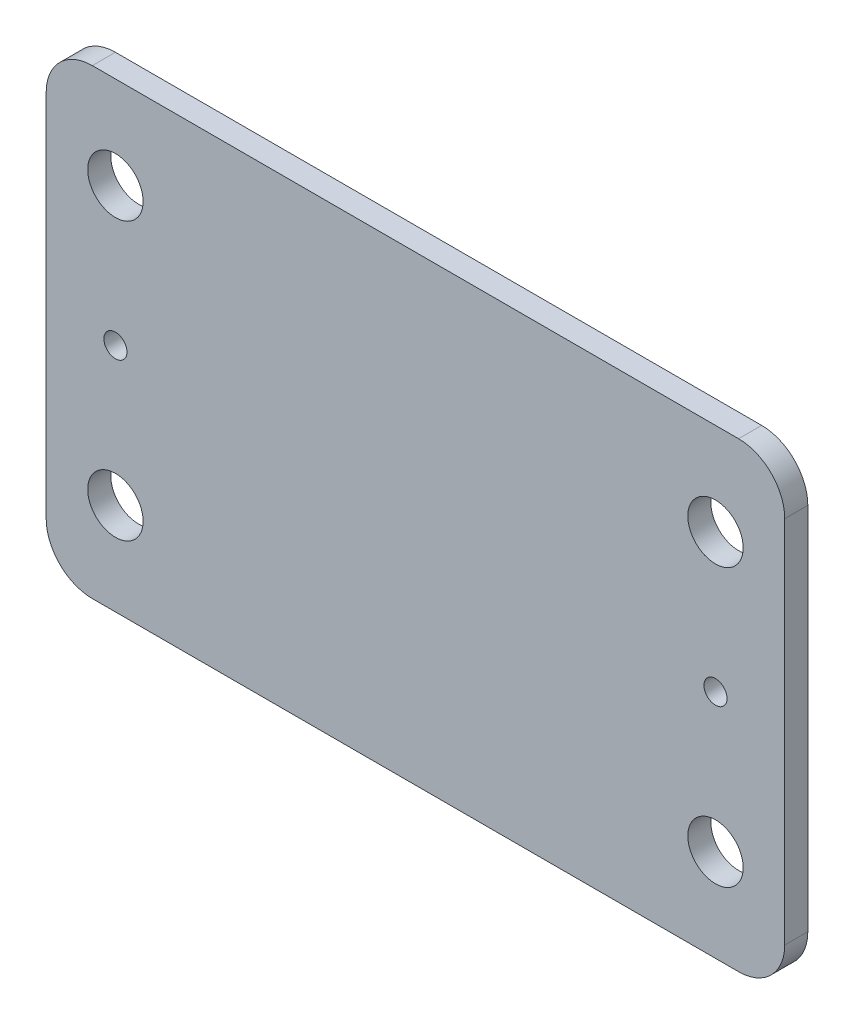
from build123d import *

# Parameters (mm, degrees)
ESQUISSE1_W             = 160
ESQUISSE1_H             = 100
BOSS_EXTRU_1_DEPTH      = 5
ESQUISSE2_R             = 6
ENL_V_MAT_EXTRU_1_DEPTH = 189.745860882
CONG_1_R                = 10
ESQUISSE3_R             = 2.5
ENL_V_MAT_EXTRU_2_DEPTH = 189.745860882


with BuildPart() as part:
    # Esquisse1 → Boss.-Extru.1 (new body)
    with BuildSketch(Plane.XY):
        with Locations((80, 50)):
            Rectangle(ESQUISSE1_W, ESQUISSE1_H)
    extrude(amount=BOSS_EXTRU_1_DEPTH)

    # Esquisse2 → Enl_v. mat.-Extru.1 (cut, through all)
    with BuildSketch(Plane.XY.offset(5)):
        with Locations((15, 80)):
            Circle(ESQUISSE2_R)
        with Locations((145, 80)):
            Circle(ESQUISSE2_R)
        with Locations((15, 20)):
            Circle(ESQUISSE2_R)
        with Locations((145, 20)):
            Circle(ESQUISSE2_R)
    extrude(amount=-ENL_V_MAT_EXTRU_1_DEPTH, mode=Mode.SUBTRACT)

    # Cong_1
    cong_1_edges = [part.edges().sort_by_distance(p)[0] for p in [
        (0, 100, 2.5),
        (160, 100, 2.5),
        (160, 0, 2.5),
        (0, 0, 2.5),
    ]]
    fillet(cong_1_edges, radius=CONG_1_R)

    # Esquisse3 → Enl_v. mat.-Extru.2 (cut, through all)
    with BuildSketch(Plane.XY.offset(5)):
        with Locations((15, 50)):
            Circle(ESQUISSE3_R)
        with Locations((145, 50)):
            Circle(ESQUISSE3_R)
    extrude(amount=-ENL_V_MAT_EXTRU_2_DEPTH, mode=Mode.SUBTRACT)


solid = part.part
